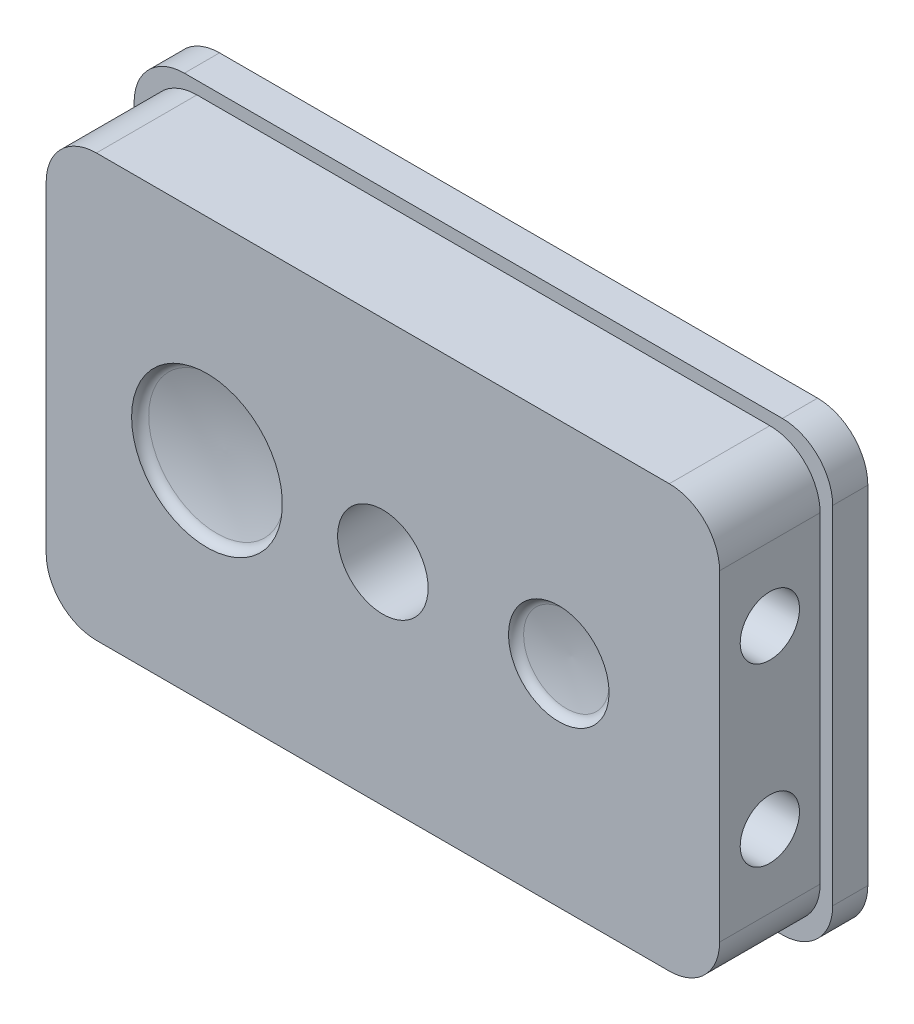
from build123d import *

# Parameters (mm, degrees)
ESQUISSE1_W             = 139
ESQUISSE1_H             = 89
EXTRUSION1_DEPTH        = 7
ESQUISSE2_W             = 134
ESQUISSE2_H             = 84
EXTRUSION2_DEPTH        = 20
CONG_1_R                = 10
CONG_2_R                = 10
ESQUISSE3_R             = 9
ENL_V_MAT_EXTRU_1_DEPTH = 87.830294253
ESQUISSE4_R             = 4
ENL_V_MAT_EXTRU_2_DEPTH = 147.087302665
ESQUISSE5_R             = 4
ENL_V_MAT_EXTRU_3_DEPTH = 57.5
ENL_V_START             = -57.5
ESQUISSE6_R             = 4
ENL_V_MAT_EXTRU_4_DEPTH = 57.5
ESQUISSE7_R             = 4
ENL_V_MAT_EXTRU_5_DEPTH = 67.5
ESQUISSE9_R             = 5.9
ENL_V_MAT_EXTRU_6_DEPTH = 24.5
ESQUISSE10_R            = 5.9
ENL_V_MAT_EXTRU_7_DEPTH = 10
ESQUISSE11_R            = 5.9
ENL_V_MAT_EXTRU_8_DEPTH = 10
ENL_V_START_2           = -10
ESQUISSE12_R            = 5.9
ENL_V_MAT_EXTRU_9_DEPTH = 10


with BuildPart() as part:
    # Esquisse1 → Extrusion1 (new body)
    with BuildSketch(Plane.XY):
        Rectangle(ESQUISSE1_W, ESQUISSE1_H)
    extrude(amount=EXTRUSION1_DEPTH)

    # Esquisse2 → Extrusion2 (add)
    with BuildSketch(Plane.XY.offset(7)):
        Rectangle(ESQUISSE2_W, ESQUISSE2_H)
    extrude(amount=EXTRUSION2_DEPTH)

    # Cong_1
    cong_1_edges = [part.edges().sort_by_distance(p)[0] for p in [
        (-67, 42, 17),
        (-67, -42, 17),
        (67, -42, 17),
        (67, 42, 17),
    ]]
    fillet(cong_1_edges, radius=CONG_1_R)

    # Cong_2
    cong_2_edges = [part.edges().sort_by_distance(p)[0] for p in [
        (-69.5, 44.5, 3.5),
        (69.5, 44.5, 3.5),
        (69.5, -44.5, 3.5),
        (-69.5, -44.5, 3.5),
    ]]
    fillet(cong_2_edges, radius=CONG_2_R)

    # Esquisse3 → Enl_v. mat.-Extru.1 (cut, through all)
    with BuildSketch(Plane.XY.offset(27)):
        Circle(ESQUISSE3_R)
    extrude(amount=-ENL_V_MAT_EXTRU_1_DEPTH, mode=Mode.SUBTRACT)

    # Esquisse4 → Enl_v. mat.-Extru.2 (cut, through all)
    with BuildSketch(Plane.ZY.offset(67)):
        with Locations(Location((17, 17.5, 0), (0, 0, 270))):
            Circle(ESQUISSE4_R)
    extrude(amount=-ENL_V_MAT_EXTRU_2_DEPTH, mode=Mode.SUBTRACT)

    # Esquisse5 → Enl_v. mat.-Extru.3 (cut)
    with BuildSketch(Plane.ZY.offset(67)):
        with Locations(Location((17, -17.5, 0), (0, 0, 270))):
            Circle(ESQUISSE5_R)
    extrude(amount=-ENL_V_MAT_EXTRU_3_DEPTH, mode=Mode.SUBTRACT)

    # Esquisse6 → Enl_v. mat.-Extru.4 (cut)
    with BuildSketch(Plane(origin=(67, 0, 0), x_dir=(0, 0, -1), z_dir=(1, 0, 0)).offset(ENL_V_START)):
        with Locations(Location((-17, -17.5, 0), (0, 0, 270))):
            Circle(ESQUISSE6_R)
    extrude(amount=ENL_V_MAT_EXTRU_4_DEPTH, mode=Mode.SUBTRACT)

    # Esquisse7 → Enl_v. mat.-Extru.5 (cut)
    with BuildSketch(Plane.XZ.offset(42)):
        with Locations((-52.5, 17)):
            Circle(ESQUISSE7_R)
        with Locations((52.5, 17)):
            Circle(ESQUISSE7_R)
    extrude(amount=-ENL_V_MAT_EXTRU_5_DEPTH, mode=Mode.SUBTRACT)

    # Esquisse9 → Enl_v. mat.-Extru.6 (cut)
    with BuildSketch(Plane.XZ.offset(42)):
        with Locations((-17.5, 17)):
            Circle(ESQUISSE9_R)
        with Locations((17.5, 17)):
            Circle(ESQUISSE9_R)
    extrude(amount=-ENL_V_MAT_EXTRU_6_DEPTH, mode=Mode.SUBTRACT)

    # Esquisse10 → Enl_v. mat.-Extru.7 (cut)
    with BuildSketch(Plane.ZY.offset(67)):
        with Locations(Location((17, 17.5, 0), (0, 0, 270))):
            Circle(ESQUISSE10_R)
        with Locations(Location((17, -17.5, 0), (0, 0, 270))):
            Circle(ESQUISSE10_R)
    extrude(amount=-ENL_V_MAT_EXTRU_7_DEPTH, mode=Mode.SUBTRACT)

    # Esquisse11 → Enl_v. mat.-Extru.8 (cut)
    with BuildSketch(Plane.XZ.offset(42)):
        with Locations((52.5, 17)):
            Circle(ESQUISSE11_R)
        with Locations((-52.5, 17)):
            Circle(ESQUISSE11_R)
    extrude(amount=-ENL_V_MAT_EXTRU_8_DEPTH, mode=Mode.SUBTRACT)

    # Esquisse12 → Enl_v. mat.-Extru.9 (cut)
    with BuildSketch(Plane(origin=(67, 0, 0), x_dir=(0, 0, -1), z_dir=(1, 0, 0)).offset(ENL_V_START_2)):
        with Locations(Location((-17, -17.5, 0), (0, 0, 270))):
            Circle(ESQUISSE12_R)
        with Locations(Location((-17, 17.5, 0), (0, 0, 270))):
            Circle(ESQUISSE12_R)
    extrude(amount=ENL_V_MAT_EXTRU_9_DEPTH, mode=Mode.SUBTRACT)

    # Esquisse13 → Enl_vement de mati_re-R_volution2 (revolve, cut)
    with BuildSketch(Plane(origin=(0, 0, 0), x_dir=(1, 0, 0), z_dir=(0, 1, 0)), mode=Mode.PRIVATE) as enl_vement_de_mati_re_r_volution2_sk:
        with BuildLine():
            Line((35, -24.5), (35, -27))
            Line((35, -27), (45, -27))
            ThreePointArc((45, -27), (44.466770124, -26.030871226), (43.5, -25.493376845))
            ThreePointArc((43.5, -25.493376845), (39.271291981, -24.814499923), (35, -24.5))
        make_face()
    revolve(enl_vement_de_mati_re_r_volution2_sk.sketch.rotate(Axis((35, 0, 19.456721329), (0, 0, 1)), 180), axis=Axis((35, 0, 19.456721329), (0, 0, 1)), mode=Mode.SUBTRACT)

    # Esquisse14 → Enl_vement de mati_re-R_volution3 (revolve, cut)
    with BuildSketch(Plane(origin=(0, 0, 0), x_dir=(1, 0, 0), z_dir=(0, 1, 0)), mode=Mode.PRIVATE) as enl_vement_de_mati_re_r_volution3_sk:
        with BuildLine():
            Line((-35, -23.4), (-35, -27))
            Line((-35, -27), (-20, -27))
            ThreePointArc((-20, -27), (-20.426183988, -25.789819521), (-21.5, -25.087616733))
            ThreePointArc((-21.5, -25.087616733), (-28.192331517, -23.782492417), (-35, -23.4))
        make_face()
    revolve(enl_vement_de_mati_re_r_volution3_sk.sketch.rotate(Axis((-35, 0, 18.376787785), (0, 0, 1)), 180), axis=Axis((-35, 0, 18.376787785), (0, 0, 1)), mode=Mode.SUBTRACT)


solid = part.part
